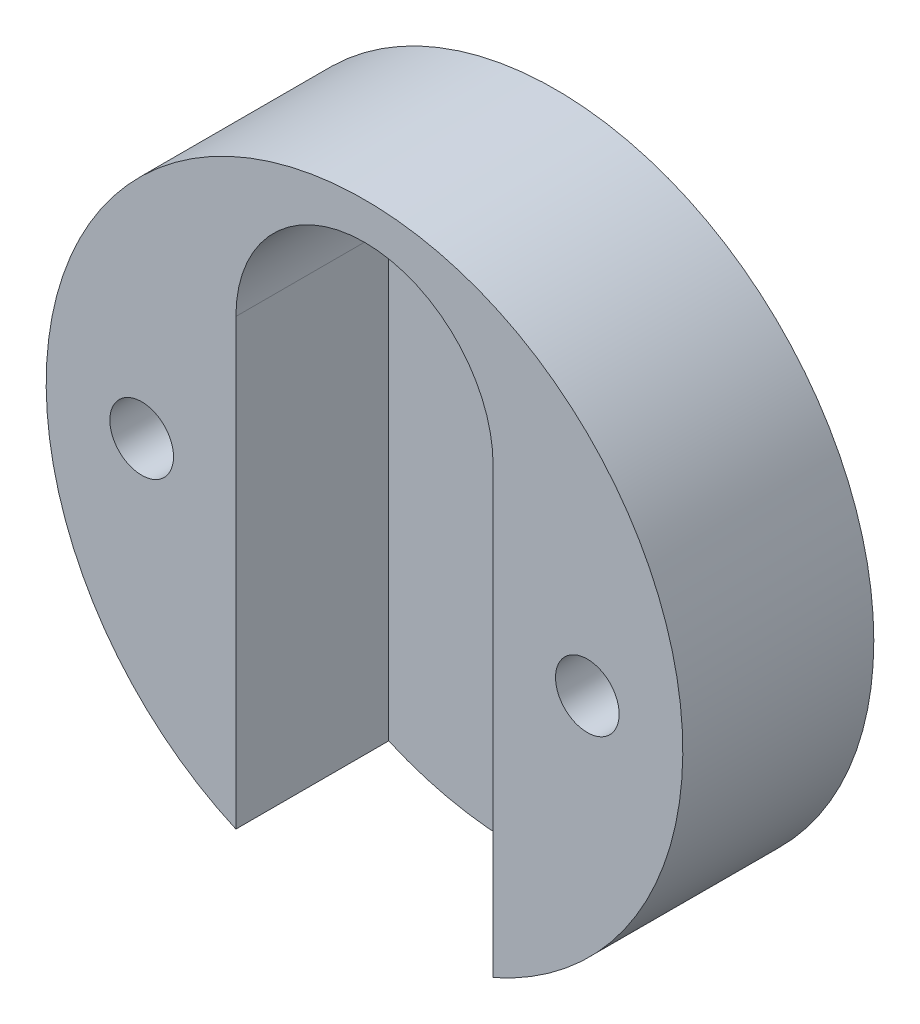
ISO-10303-21;
HEADER;
FILE_DESCRIPTION(('STEP AP214'),'2;1');
FILE_NAME('part.step','',(''),(''),'','','');
FILE_SCHEMA(('AUTOMOTIVE_DESIGN { 1 0 10303 214 1 1 1 1 }'));
ENDSEC;
DATA;
#1=APPLICATION_CONTEXT('core data for automotive mechanical design processes');
#2=APPLICATION_PROTOCOL_DEFINITION('international standard','automotive_design',2000,#1);
#3=PRODUCT_CONTEXT('',#1,'mechanical');
#4=PRODUCT('Part','Part','',(#3));
#5=PRODUCT_RELATED_PRODUCT_CATEGORY('part','',(#4));
#6=PRODUCT_DEFINITION_FORMATION('','',#4);
#7=PRODUCT_DEFINITION_CONTEXT('part definition',#1,'design');
#8=PRODUCT_DEFINITION('design','',#6,#7);
#9=PRODUCT_DEFINITION_SHAPE('','',#8);
#10=(LENGTH_UNIT() NAMED_UNIT(*) SI_UNIT(.MILLI.,.METRE.));
#11=(NAMED_UNIT(*) PLANE_ANGLE_UNIT() SI_UNIT($,.RADIAN.));
#12=(NAMED_UNIT(*) SI_UNIT($,.STERADIAN.) SOLID_ANGLE_UNIT());
#13=UNCERTAINTY_MEASURE_WITH_UNIT(LENGTH_MEASURE(1.E-05),#10,'distance_accuracy_value','');
#14=(GEOMETRIC_REPRESENTATION_CONTEXT(3) GLOBAL_UNCERTAINTY_ASSIGNED_CONTEXT((#13)) GLOBAL_UNIT_ASSIGNED_CONTEXT((#10,
#11,#12)) REPRESENTATION_CONTEXT('',''));
#15=CARTESIAN_POINT('',(0.,0.,0.));
#16=DIRECTION('',(0.,0.,1.));
#17=DIRECTION('',(1.,0.,0.));
#18=AXIS2_PLACEMENT_3D('',#15,#16,#17);
#19=CARTESIAN_POINT('',(2.1094237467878E-12,0.,14.9999999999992));
#20=DIRECTION('',(0.,0.,-0.999999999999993));
#21=DIRECTION('',(-1.,0.,0.));
#22=AXIS2_PLACEMENT_3D('',#19,#20,#21);
#23=CYLINDRICAL_SURFACE('',#22,25.);
#24=CARTESIAN_POINT('',(0.,0.,2.99999999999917));
#25=DIRECTION('',(0.,0.,-0.999999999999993));
#26=DIRECTION('',(-1.,0.,0.));
#27=AXIS2_PLACEMENT_3D('',#24,#25,#26);
#28=CIRCLE('',#27,25.);
#29=CARTESIAN_POINT('',(10.0999999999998,-22.8689746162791,2.99999999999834));
#30=VERTEX_POINT('',#29);
#31=CARTESIAN_POINT('',(-10.1000000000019,-22.8689746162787,2.99999999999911));
#32=VERTEX_POINT('',#31);
#33=EDGE_CURVE('E11',#30,#32,#28,.T.);
#34=ORIENTED_EDGE('',*,*,#33,.T.);
#35=DIRECTION('',(0.,0.,-0.999999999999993));
#36=VECTOR('',#35,1.);
#37=CARTESIAN_POINT('',(-10.1000000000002,-22.8689746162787,14.9999999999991));
#38=LINE('',#37,#36);
#39=CARTESIAN_POINT('',(-10.1000000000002,-22.8689746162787,14.9999999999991));
#40=VERTEX_POINT('',#39);
#41=EDGE_CURVE('E61',#32,#40,#38,.F.);
#42=ORIENTED_EDGE('',*,*,#41,.T.);
#43=CARTESIAN_POINT('',(2.1094237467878E-12,0.,14.9999999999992));
#44=DIRECTION('',(0.,0.,0.999999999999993));
#45=DIRECTION('',(1.,0.,0.));
#46=AXIS2_PLACEMENT_3D('',#43,#44,#45);
#47=CIRCLE('',#46,25.);
#48=CARTESIAN_POINT('',(10.1000000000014,-22.8689746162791,14.9999999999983));
#49=VERTEX_POINT('',#48);
#50=EDGE_CURVE('E88',#49,#40,#47,.T.);
#51=ORIENTED_EDGE('',*,*,#50,.F.);
#52=DIRECTION('',(0.,0.,-0.999999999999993));
#53=VECTOR('',#52,1.);
#54=CARTESIAN_POINT('',(10.1000000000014,-22.8689746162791,14.9999999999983));
#55=LINE('',#54,#53);
#56=EDGE_CURVE('E53',#49,#30,#55,.T.);
#57=ORIENTED_EDGE('',*,*,#56,.T.);
#58=EDGE_LOOP('',(#34,#42,#51,#57));
#59=FACE_BOUND('',#58,.T.);
#60=CARTESIAN_POINT('',(0.,0.,-8.32667268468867E-13));
#61=DIRECTION('',(0.,0.,0.999999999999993));
#62=DIRECTION('',(1.,0.,0.));
#63=AXIS2_PLACEMENT_3D('',#60,#61,#62);
#64=CIRCLE('',#63,25.);
#65=CARTESIAN_POINT('',(25.,0.,-8.29600844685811E-13));
#66=VERTEX_POINT('',#65);
#67=EDGE_CURVE('E127',#66,#66,#64,.T.);
#68=ORIENTED_EDGE('',*,*,#67,.T.);
#69=EDGE_LOOP('',(#68));
#70=FACE_BOUND('',#69,.T.);
#71=ADVANCED_FACE('F38',(#59,#70),#23,.T.);
#72=CARTESIAN_POINT('',(2.1094237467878E-12,0.,14.9999999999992));
#73=DIRECTION('',(0.,0.,0.999999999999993));
#74=DIRECTION('',(1.,0.,0.));
#75=AXIS2_PLACEMENT_3D('',#72,#73,#74);
#76=PLANE('',#75);
#77=CARTESIAN_POINT('',(17.5000000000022,-4.44089209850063E-13,14.9999999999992));
#78=DIRECTION('',(0.,0.,0.999999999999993));
#79=DIRECTION('',(1.,0.,0.));
#80=AXIS2_PLACEMENT_3D('',#77,#78,#79);
#81=CIRCLE('',#80,2.49999999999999);
#82=CARTESIAN_POINT('',(20.0000000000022,-4.44349418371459E-13,14.9999999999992));
#83=VERTEX_POINT('',#82);
#84=EDGE_CURVE('E178',#83,#83,#81,.T.);
#85=ORIENTED_EDGE('',*,*,#84,.F.);
#86=EDGE_LOOP('',(#85));
#87=FACE_BOUND('',#86,.T.);
#88=CARTESIAN_POINT('',(-17.499999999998,0.,14.9999999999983));
#89=DIRECTION('',(0.,0.,0.999999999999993));
#90=DIRECTION('',(1.,0.,0.));
#91=AXIS2_PLACEMENT_3D('',#88,#89,#90);
#92=CIRCLE('',#91,2.49999999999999);
#93=CARTESIAN_POINT('',(-14.999999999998,0.,14.9999999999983));
#94=VERTEX_POINT('',#93);
#95=EDGE_CURVE('E103',#94,#94,#92,.T.);
#96=ORIENTED_EDGE('',*,*,#95,.F.);
#97=EDGE_LOOP('',(#96));
#98=FACE_BOUND('',#97,.T.);
#99=DIRECTION('',(0.,-1.,0.));
#100=VECTOR('',#99,1.);
#101=CARTESIAN_POINT('',(-10.1000000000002,-24.9999999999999,14.9999999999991));
#102=LINE('',#101,#100);
#103=CARTESIAN_POINT('',(-10.0999999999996,12.,14.9999999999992));
#104=VERTEX_POINT('',#103);
#105=EDGE_CURVE('E101',#104,#40,#102,.T.);
#106=ORIENTED_EDGE('',*,*,#105,.F.);
#107=CARTESIAN_POINT('',(4.44089209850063E-13,12.,14.9999999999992));
#108=DIRECTION('',(0.,0.,0.999999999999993));
#109=DIRECTION('',(-1.,0.,0.));
#110=AXIS2_PLACEMENT_3D('',#107,#108,#109);
#111=CIRCLE('',#110,10.1);
#112=CARTESIAN_POINT('',(10.1000000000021,11.9999999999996,14.9999999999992));
#113=VERTEX_POINT('',#112);
#114=EDGE_CURVE('E92',#113,#104,#111,.T.);
#115=ORIENTED_EDGE('',*,*,#114,.F.);
#116=DIRECTION('',(0.,1.,0.));
#117=VECTOR('',#116,1.);
#118=CARTESIAN_POINT('',(10.1000000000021,-4.44089209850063E-13,14.9999999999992));
#119=LINE('',#118,#117);
#120=EDGE_CURVE('E46',#49,#113,#119,.T.);
#121=ORIENTED_EDGE('',*,*,#120,.F.);
#122=ORIENTED_EDGE('',*,*,#50,.T.);
#123=EDGE_LOOP('',(#106,#115,#121,#122));
#124=FACE_BOUND('',#123,.T.);
#125=ADVANCED_FACE('F100',(#87,#98,#124),#76,.T.);
#126=CARTESIAN_POINT('',(0.,0.,-8.32667268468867E-13));
#127=DIRECTION('',(0.,0.,0.999999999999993));
#128=DIRECTION('',(1.,0.,0.));
#129=AXIS2_PLACEMENT_3D('',#126,#127,#128);
#130=PLANE('',#129);
#131=CARTESIAN_POINT('',(17.5000000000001,-4.44089209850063E-13,-8.32667268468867E-13));
#132=DIRECTION('',(0.,0.,0.999999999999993));
#133=DIRECTION('',(1.,0.,0.));
#134=AXIS2_PLACEMENT_3D('',#131,#132,#133);
#135=CIRCLE('',#134,2.5);
#136=CARTESIAN_POINT('',(20.0000000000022,-4.44194342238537E-13,-8.32667268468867E-13));
#137=VERTEX_POINT('',#136);
#138=EDGE_CURVE('E181',#137,#137,#135,.T.);
#139=ORIENTED_EDGE('',*,*,#138,.T.);
#140=EDGE_LOOP('',(#139));
#141=FACE_BOUND('',#140,.T.);
#142=CARTESIAN_POINT('',(-17.5000000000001,0.,-1.66533453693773E-12));
#143=DIRECTION('',(0.,0.,0.999999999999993));
#144=DIRECTION('',(1.,0.,0.));
#145=AXIS2_PLACEMENT_3D('',#142,#143,#144);
#146=CIRCLE('',#145,2.5);
#147=CARTESIAN_POINT('',(-14.999999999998,0.,-1.66533453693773E-12));
#148=VERTEX_POINT('',#147);
#149=EDGE_CURVE('E111',#148,#148,#146,.T.);
#150=ORIENTED_EDGE('',*,*,#149,.T.);
#151=EDGE_LOOP('',(#150));
#152=FACE_BOUND('',#151,.T.);
#153=ORIENTED_EDGE('',*,*,#67,.F.);
#154=EDGE_LOOP('',(#153));
#155=FACE_BOUND('',#154,.T.);
#156=ADVANCED_FACE('F145',(#141,#152,#155),#130,.F.);
#157=CARTESIAN_POINT('',(4.44089209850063E-13,12.,2.99999999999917));
#158=DIRECTION('',(0.,0.,-0.999999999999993));
#159=DIRECTION('',(-1.,0.,0.));
#160=AXIS2_PLACEMENT_3D('',#157,#158,#159);
#161=PLANE('',#160);
#162=DIRECTION('',(0.,1.,0.));
#163=VECTOR('',#162,1.);
#164=CARTESIAN_POINT('',(10.1000000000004,11.9999999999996,2.99999999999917));
#165=LINE('',#164,#163);
#166=CARTESIAN_POINT('',(10.1000000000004,11.9999999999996,2.99999999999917));
#167=VERTEX_POINT('',#166);
#168=EDGE_CURVE('E107',#30,#167,#165,.T.);
#169=ORIENTED_EDGE('',*,*,#168,.T.);
#170=CARTESIAN_POINT('',(4.44089209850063E-13,12.,2.99999999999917));
#171=DIRECTION('',(0.,0.,0.999999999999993));
#172=DIRECTION('',(-1.,0.,0.));
#173=AXIS2_PLACEMENT_3D('',#170,#171,#172);
#174=CIRCLE('',#173,10.1);
#175=CARTESIAN_POINT('',(-10.0999999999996,12.,2.99999999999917));
#176=VERTEX_POINT('',#175);
#177=EDGE_CURVE('E95',#167,#176,#174,.T.);
#178=ORIENTED_EDGE('',*,*,#177,.T.);
#179=DIRECTION('',(0.,-1.,0.));
#180=VECTOR('',#179,1.);
#181=CARTESIAN_POINT('',(-10.1000000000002,-24.9999999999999,2.99999999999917));
#182=LINE('',#181,#180);
#183=EDGE_CURVE('E98',#176,#32,#182,.T.);
#184=ORIENTED_EDGE('',*,*,#183,.T.);
#185=ORIENTED_EDGE('',*,*,#33,.F.);
#186=EDGE_LOOP('',(#169,#178,#184,#185));
#187=FACE_BOUND('',#186,.T.);
#188=ADVANCED_FACE('F136',(#187),#161,.F.);
#189=CARTESIAN_POINT('',(-10.1000000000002,-24.9999999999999,2.99999999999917));
#190=DIRECTION('',(-1.,0.,0.));
#191=DIRECTION('',(0.,-1.,0.));
#192=AXIS2_PLACEMENT_3D('',#189,#190,#191);
#193=PLANE('',#192);
#194=ORIENTED_EDGE('',*,*,#183,.F.);
#195=DIRECTION('',(0.,0.,0.999999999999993));
#196=VECTOR('',#195,1.);
#197=CARTESIAN_POINT('',(-10.0999999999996,12.,2.99999999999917));
#198=LINE('',#197,#196);
#199=EDGE_CURVE('E97',#176,#104,#198,.T.);
#200=ORIENTED_EDGE('',*,*,#199,.T.);
#201=ORIENTED_EDGE('',*,*,#105,.T.);
#202=ORIENTED_EDGE('',*,*,#41,.F.);
#203=EDGE_LOOP('',(#194,#200,#201,#202));
#204=FACE_BOUND('',#203,.T.);
#205=ADVANCED_FACE('F137',(#204),#193,.F.);
#206=CARTESIAN_POINT('',(10.1000000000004,11.9999999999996,2.99999999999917));
#207=DIRECTION('',(1.,0.,0.));
#208=DIRECTION('',(0.,1.,0.));
#209=AXIS2_PLACEMENT_3D('',#206,#207,#208);
#210=PLANE('',#209);
#211=ORIENTED_EDGE('',*,*,#120,.T.);
#212=DIRECTION('',(0.,0.,0.999999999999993));
#213=VECTOR('',#212,1.);
#214=CARTESIAN_POINT('',(10.1000000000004,11.9999999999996,2.99999999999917));
#215=LINE('',#214,#213);
#216=EDGE_CURVE('E81',#167,#113,#215,.T.);
#217=ORIENTED_EDGE('',*,*,#216,.F.);
#218=ORIENTED_EDGE('',*,*,#168,.F.);
#219=ORIENTED_EDGE('',*,*,#56,.F.);
#220=EDGE_LOOP('',(#211,#217,#218,#219));
#221=FACE_BOUND('',#220,.T.);
#222=ADVANCED_FACE('F80',(#221),#210,.F.);
#223=CARTESIAN_POINT('',(4.44089209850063E-13,12.,2.99999999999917));
#224=DIRECTION('',(0.,0.,0.999999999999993));
#225=DIRECTION('',(1.,0.,0.));
#226=AXIS2_PLACEMENT_3D('',#223,#224,#225);
#227=CYLINDRICAL_SURFACE('',#226,10.1);
#228=ORIENTED_EDGE('',*,*,#114,.T.);
#229=ORIENTED_EDGE('',*,*,#199,.F.);
#230=ORIENTED_EDGE('',*,*,#177,.F.);
#231=ORIENTED_EDGE('',*,*,#216,.T.);
#232=EDGE_LOOP('',(#228,#229,#230,#231));
#233=FACE_BOUND('',#232,.T.);
#234=ADVANCED_FACE('F91',(#233),#227,.F.);
#235=CARTESIAN_POINT('',(-17.499999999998,0.,14.9999999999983));
#236=DIRECTION('',(0.,0.,0.999999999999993));
#237=DIRECTION('',(1.,0.,0.));
#238=AXIS2_PLACEMENT_3D('',#235,#236,#237);
#239=CYLINDRICAL_SURFACE('',#238,2.49999999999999);
#240=CARTESIAN_POINT('',(-14.999999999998,0.,-1.66533453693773E-12));
#241=CARTESIAN_POINT('',(-14.999999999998,0.,0.156249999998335));
#242=CARTESIAN_POINT('',(-14.999999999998,0.,0.312499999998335));
#243=CARTESIAN_POINT('',(-14.999999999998,0.,0.624999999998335));
#244=CARTESIAN_POINT('',(-14.999999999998,0.,0.781249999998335));
#245=CARTESIAN_POINT('',(-14.999999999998,0.,1.09374999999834));
#246=CARTESIAN_POINT('',(-14.999999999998,0.,1.24999999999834));
#247=CARTESIAN_POINT('',(-14.999999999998,0.,1.56249999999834));
#248=CARTESIAN_POINT('',(-14.999999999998,0.,1.71874999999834));
#249=CARTESIAN_POINT('',(-14.999999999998,0.,2.03124999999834));
#250=CARTESIAN_POINT('',(-14.999999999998,0.,2.18749999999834));
#251=CARTESIAN_POINT('',(-14.999999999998,0.,2.49999999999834));
#252=CARTESIAN_POINT('',(-14.999999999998,0.,2.65624999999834));
#253=CARTESIAN_POINT('',(-14.999999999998,0.,2.96874999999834));
#254=CARTESIAN_POINT('',(-14.999999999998,0.,3.12499999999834));
#255=CARTESIAN_POINT('',(-14.999999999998,0.,3.43749999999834));
#256=CARTESIAN_POINT('',(-14.999999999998,0.,3.59374999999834));
#257=CARTESIAN_POINT('',(-14.999999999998,0.,3.90624999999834));
#258=CARTESIAN_POINT('',(-14.999999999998,0.,4.06249999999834));
#259=CARTESIAN_POINT('',(-14.999999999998,0.,4.37499999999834));
#260=CARTESIAN_POINT('',(-14.999999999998,0.,4.53124999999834));
#261=CARTESIAN_POINT('',(-14.999999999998,0.,4.84374999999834));
#262=CARTESIAN_POINT('',(-14.999999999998,0.,4.99999999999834));
#263=CARTESIAN_POINT('',(-14.999999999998,0.,5.31249999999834));
#264=CARTESIAN_POINT('',(-14.999999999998,0.,5.46874999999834));
#265=CARTESIAN_POINT('',(-14.999999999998,0.,5.78124999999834));
#266=CARTESIAN_POINT('',(-14.999999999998,0.,5.93749999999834));
#267=CARTESIAN_POINT('',(-14.999999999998,0.,6.24999999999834));
#268=CARTESIAN_POINT('',(-14.999999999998,0.,6.40624999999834));
#269=CARTESIAN_POINT('',(-14.999999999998,0.,6.71874999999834));
#270=CARTESIAN_POINT('',(-14.999999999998,0.,6.87499999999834));
#271=CARTESIAN_POINT('',(-14.999999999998,0.,7.18749999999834));
#272=CARTESIAN_POINT('',(-14.999999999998,0.,7.34374999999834));
#273=CARTESIAN_POINT('',(-14.999999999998,0.,7.65624999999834));
#274=CARTESIAN_POINT('',(-14.999999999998,0.,7.81249999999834));
#275=CARTESIAN_POINT('',(-14.999999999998,0.,8.12499999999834));
#276=CARTESIAN_POINT('',(-14.999999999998,0.,8.28124999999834));
#277=CARTESIAN_POINT('',(-14.999999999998,0.,8.59374999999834));
#278=CARTESIAN_POINT('',(-14.999999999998,0.,8.74999999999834));
#279=CARTESIAN_POINT('',(-14.999999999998,0.,9.06249999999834));
#280=CARTESIAN_POINT('',(-14.999999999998,0.,9.21874999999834));
#281=CARTESIAN_POINT('',(-14.999999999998,0.,9.53124999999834));
#282=CARTESIAN_POINT('',(-14.999999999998,0.,9.68749999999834));
#283=CARTESIAN_POINT('',(-14.999999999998,0.,9.99999999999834));
#284=CARTESIAN_POINT('',(-14.999999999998,0.,10.1562499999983));
#285=CARTESIAN_POINT('',(-14.999999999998,0.,10.4687499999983));
#286=CARTESIAN_POINT('',(-14.999999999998,0.,10.6249999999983));
#287=CARTESIAN_POINT('',(-14.999999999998,0.,10.9374999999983));
#288=CARTESIAN_POINT('',(-14.999999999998,0.,11.0937499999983));
#289=CARTESIAN_POINT('',(-14.999999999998,0.,11.4062499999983));
#290=CARTESIAN_POINT('',(-14.999999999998,0.,11.5624999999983));
#291=CARTESIAN_POINT('',(-14.999999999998,0.,11.8749999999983));
#292=CARTESIAN_POINT('',(-14.999999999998,0.,12.0312499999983));
#293=CARTESIAN_POINT('',(-14.999999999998,0.,12.3437499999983));
#294=CARTESIAN_POINT('',(-14.999999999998,0.,12.4999999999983));
#295=CARTESIAN_POINT('',(-14.999999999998,0.,12.8124999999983));
#296=CARTESIAN_POINT('',(-14.999999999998,0.,12.9687499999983));
#297=CARTESIAN_POINT('',(-14.999999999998,0.,13.2812499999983));
#298=CARTESIAN_POINT('',(-14.999999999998,0.,13.4374999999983));
#299=CARTESIAN_POINT('',(-14.999999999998,0.,13.7499999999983));
#300=CARTESIAN_POINT('',(-14.999999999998,0.,13.9062499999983));
#301=CARTESIAN_POINT('',(-14.999999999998,0.,14.2187499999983));
#302=CARTESIAN_POINT('',(-14.999999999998,0.,14.3749999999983));
#303=CARTESIAN_POINT('',(-14.999999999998,0.,14.6874999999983));
#304=CARTESIAN_POINT('',(-14.999999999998,0.,14.8437499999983));
#305=CARTESIAN_POINT('',(-14.999999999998,0.,14.9999999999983));
#306=B_SPLINE_CURVE_WITH_KNOTS('',3,(#240,#241,#242,#243,#244,#245,#246,#247,#248,#249,#250,
#251,#252,#253,#254,#255,#256,#257,#258,#259,#260,#261,#262,#263,#264,#265,#266,#267,#268,#269,
#270,#271,#272,#273,#274,#275,#276,#277,#278,#279,#280,#281,#282,#283,#284,#285,#286,#287,#288,
#289,#290,#291,#292,#293,#294,#295,#296,#297,#298,#299,#300,#301,#302,#303,#304,#305),
.UNSPECIFIED.,.F.,.F.,(4,2,2,2,2,2,2,2,2,2,2,2,2,2,2,2,2,2,2,2,2,2,2,2,2,2,2,2,2,2,2,2,4),(0.,
0.46875,0.937500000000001,1.40625,1.875,2.34375,2.8125,3.28125,3.75,4.21875,4.6875,5.15625,
5.62500000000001,6.09375000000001,6.56250000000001,7.03125000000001,7.50000000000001,
7.96875000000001,8.43750000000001,8.90625000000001,9.37500000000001,9.84375000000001,10.3125,
10.78125,11.25,11.71875,12.1875,12.65625,13.125,13.59375,14.0625,14.53125,15.),.UNSPECIFIED.);
#307=EDGE_CURVE('BSEAM161',#148,#94,#306,.T.);
#308=ORIENTED_EDGE('',*,*,#149,.F.);
#309=ORIENTED_EDGE('',*,*,#95,.T.);
#310=ORIENTED_EDGE('',*,*,#307,.T.);
#311=ORIENTED_EDGE('',*,*,#307,.F.);
#312=EDGE_LOOP('',(#308,#310,#309,#311));
#313=FACE_BOUND('',#312,.T.);
#314=ADVANCED_FACE('F161',(#313),#239,.F.);
#315=CARTESIAN_POINT('',(17.5000000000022,-4.44089209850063E-13,14.9999999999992));
#316=DIRECTION('',(0.,0.,0.999999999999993));
#317=DIRECTION('',(1.,0.,0.));
#318=AXIS2_PLACEMENT_3D('',#315,#316,#317);
#319=CYLINDRICAL_SURFACE('',#318,2.49999999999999);
#320=CARTESIAN_POINT('',(20.0000000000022,-4.44194342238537E-13,-8.32667268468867E-13));
#321=CARTESIAN_POINT('',(20.0000000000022,-4.44195957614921E-13,0.156249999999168));
#322=CARTESIAN_POINT('',(20.0000000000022,-4.44197572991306E-13,0.312499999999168));
#323=CARTESIAN_POINT('',(20.0000000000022,-4.44200803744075E-13,0.624999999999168));
#324=CARTESIAN_POINT('',(20.0000000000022,-4.44202419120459E-13,0.781249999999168));
#325=CARTESIAN_POINT('',(20.0000000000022,-4.44205649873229E-13,1.09374999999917));
#326=CARTESIAN_POINT('',(20.0000000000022,-4.44207265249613E-13,1.24999999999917));
#327=CARTESIAN_POINT('',(20.0000000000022,-4.44210496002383E-13,1.56249999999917));
#328=CARTESIAN_POINT('',(20.0000000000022,-4.44212111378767E-13,1.71874999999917));
#329=CARTESIAN_POINT('',(20.0000000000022,-4.44215342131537E-13,2.03124999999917));
#330=CARTESIAN_POINT('',(20.0000000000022,-4.44216957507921E-13,2.18749999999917));
#331=CARTESIAN_POINT('',(20.0000000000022,-4.4422018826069E-13,2.49999999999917));
#332=CARTESIAN_POINT('',(20.0000000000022,-4.44221803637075E-13,2.65624999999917));
#333=CARTESIAN_POINT('',(20.0000000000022,-4.44225034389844E-13,2.96874999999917));
#334=CARTESIAN_POINT('',(20.0000000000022,-4.44226649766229E-13,3.12499999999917));
#335=CARTESIAN_POINT('',(20.0000000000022,-4.44229880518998E-13,3.43749999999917));
#336=CARTESIAN_POINT('',(20.0000000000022,-4.44231495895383E-13,3.59374999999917));
#337=CARTESIAN_POINT('',(20.0000000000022,-4.44234726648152E-13,3.90624999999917));
#338=CARTESIAN_POINT('',(20.0000000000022,-4.44236342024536E-13,4.06249999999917));
#339=CARTESIAN_POINT('',(20.0000000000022,-4.44239572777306E-13,4.37499999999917));
#340=CARTESIAN_POINT('',(20.0000000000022,-4.4424118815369E-13,4.53124999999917));
#341=CARTESIAN_POINT('',(20.0000000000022,-4.44244418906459E-13,4.84374999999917));
#342=CARTESIAN_POINT('',(20.0000000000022,-4.44246034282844E-13,4.99999999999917));
#343=CARTESIAN_POINT('',(20.0000000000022,-4.44249265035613E-13,5.31249999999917));
#344=CARTESIAN_POINT('',(20.0000000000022,-4.44250880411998E-13,5.46874999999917));
#345=CARTESIAN_POINT('',(20.0000000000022,-4.44254111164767E-13,5.78124999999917));
#346=CARTESIAN_POINT('',(20.0000000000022,-4.44255726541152E-13,5.93749999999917));
#347=CARTESIAN_POINT('',(20.0000000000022,-4.44258957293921E-13,6.24999999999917));
#348=CARTESIAN_POINT('',(20.0000000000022,-4.44260572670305E-13,6.40624999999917));
#349=CARTESIAN_POINT('',(20.0000000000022,-4.44263803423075E-13,6.71874999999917));
#350=CARTESIAN_POINT('',(20.0000000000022,-4.44265418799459E-13,6.87499999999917));
#351=CARTESIAN_POINT('',(20.0000000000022,-4.44268649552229E-13,7.18749999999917));
#352=CARTESIAN_POINT('',(20.0000000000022,-4.44270264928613E-13,7.34374999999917));
#353=CARTESIAN_POINT('',(20.0000000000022,-4.44273495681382E-13,7.65624999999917));
#354=CARTESIAN_POINT('',(20.0000000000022,-4.44275111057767E-13,7.81249999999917));
#355=CARTESIAN_POINT('',(20.0000000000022,-4.44278341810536E-13,8.12499999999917));
#356=CARTESIAN_POINT('',(20.0000000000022,-4.44279957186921E-13,8.28124999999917));
#357=CARTESIAN_POINT('',(20.0000000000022,-4.4428318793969E-13,8.59374999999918));
#358=CARTESIAN_POINT('',(20.0000000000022,-4.44284803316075E-13,8.74999999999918));
#359=CARTESIAN_POINT('',(20.0000000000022,-4.44288034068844E-13,9.06249999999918));
#360=CARTESIAN_POINT('',(20.0000000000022,-4.44289649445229E-13,9.21874999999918));
#361=CARTESIAN_POINT('',(20.0000000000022,-4.44292880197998E-13,9.53124999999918));
#362=CARTESIAN_POINT('',(20.0000000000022,-4.44294495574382E-13,9.68749999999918));
#363=CARTESIAN_POINT('',(20.0000000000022,-4.44297726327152E-13,9.99999999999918));
#364=CARTESIAN_POINT('',(20.0000000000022,-4.44299341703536E-13,10.1562499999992));
#365=CARTESIAN_POINT('',(20.0000000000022,-4.44302572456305E-13,10.4687499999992));
#366=CARTESIAN_POINT('',(20.0000000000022,-4.4430418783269E-13,10.6249999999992));
#367=CARTESIAN_POINT('',(20.0000000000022,-4.44307418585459E-13,10.9374999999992));
#368=CARTESIAN_POINT('',(20.0000000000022,-4.44309033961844E-13,11.0937499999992));
#369=CARTESIAN_POINT('',(20.0000000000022,-4.44312264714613E-13,11.4062499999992));
#370=CARTESIAN_POINT('',(20.0000000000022,-4.44313880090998E-13,11.5624999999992));
#371=CARTESIAN_POINT('',(20.0000000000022,-4.44317110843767E-13,11.8749999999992));
#372=CARTESIAN_POINT('',(20.0000000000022,-4.44318726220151E-13,12.0312499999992));
#373=CARTESIAN_POINT('',(20.0000000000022,-4.44321956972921E-13,12.3437499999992));
#374=CARTESIAN_POINT('',(20.0000000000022,-4.44323572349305E-13,12.4999999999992));
#375=CARTESIAN_POINT('',(20.0000000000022,-4.44326803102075E-13,12.8124999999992));
#376=CARTESIAN_POINT('',(20.0000000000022,-4.44328418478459E-13,12.9687499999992));
#377=CARTESIAN_POINT('',(20.0000000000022,-4.44331649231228E-13,13.2812499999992));
#378=CARTESIAN_POINT('',(20.0000000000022,-4.44333264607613E-13,13.4374999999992));
#379=CARTESIAN_POINT('',(20.0000000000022,-4.44336495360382E-13,13.7499999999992));
#380=CARTESIAN_POINT('',(20.0000000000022,-4.44338110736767E-13,13.9062499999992));
#381=CARTESIAN_POINT('',(20.0000000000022,-4.44341341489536E-13,14.2187499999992));
#382=CARTESIAN_POINT('',(20.0000000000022,-4.44342956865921E-13,14.3749999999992));
#383=CARTESIAN_POINT('',(20.0000000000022,-4.4434618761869E-13,14.6874999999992));
#384=CARTESIAN_POINT('',(20.0000000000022,-4.44347802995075E-13,14.8437499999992));
#385=CARTESIAN_POINT('',(20.0000000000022,-4.44349418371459E-13,14.9999999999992));
#386=B_SPLINE_CURVE_WITH_KNOTS('',3,(#320,#321,#322,#323,#324,#325,#326,#327,#328,#329,#330,
#331,#332,#333,#334,#335,#336,#337,#338,#339,#340,#341,#342,#343,#344,#345,#346,#347,#348,#349,
#350,#351,#352,#353,#354,#355,#356,#357,#358,#359,#360,#361,#362,#363,#364,#365,#366,#367,#368,
#369,#370,#371,#372,#373,#374,#375,#376,#377,#378,#379,#380,#381,#382,#383,#384,#385),
.UNSPECIFIED.,.F.,.F.,(4,2,2,2,2,2,2,2,2,2,2,2,2,2,2,2,2,2,2,2,2,2,2,2,2,2,2,2,2,2,2,2,4),(0.,
0.46875,0.937500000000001,1.40625,1.875,2.34375,2.8125,3.28125,3.75,4.21875,4.6875,5.15625,
5.62500000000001,6.09375000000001,6.56250000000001,7.03125000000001,7.50000000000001,
7.96875000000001,8.43750000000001,8.90625000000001,9.37500000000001,9.84375000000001,10.3125,
10.78125,11.25,11.71875,12.1875,12.65625,13.125,13.59375,14.0625,14.53125,15.),.UNSPECIFIED.);
#387=EDGE_CURVE('BSEAM165',#137,#83,#386,.T.);
#388=ORIENTED_EDGE('',*,*,#138,.F.);
#389=ORIENTED_EDGE('',*,*,#84,.T.);
#390=ORIENTED_EDGE('',*,*,#387,.T.);
#391=ORIENTED_EDGE('',*,*,#387,.F.);
#392=EDGE_LOOP('',(#388,#390,#389,#391));
#393=FACE_BOUND('',#392,.T.);
#394=ADVANCED_FACE('F165',(#393),#319,.F.);
#395=CLOSED_SHELL('',(#71,#125,#156,#188,#205,#222,#234,#314,#394));
#396=MANIFOLD_SOLID_BREP('B2',#395);
#397=ADVANCED_BREP_SHAPE_REPRESENTATION('',(#18,#396),#14);
#398=SHAPE_DEFINITION_REPRESENTATION(#9,#397);
ENDSEC;
END-ISO-10303-21;
